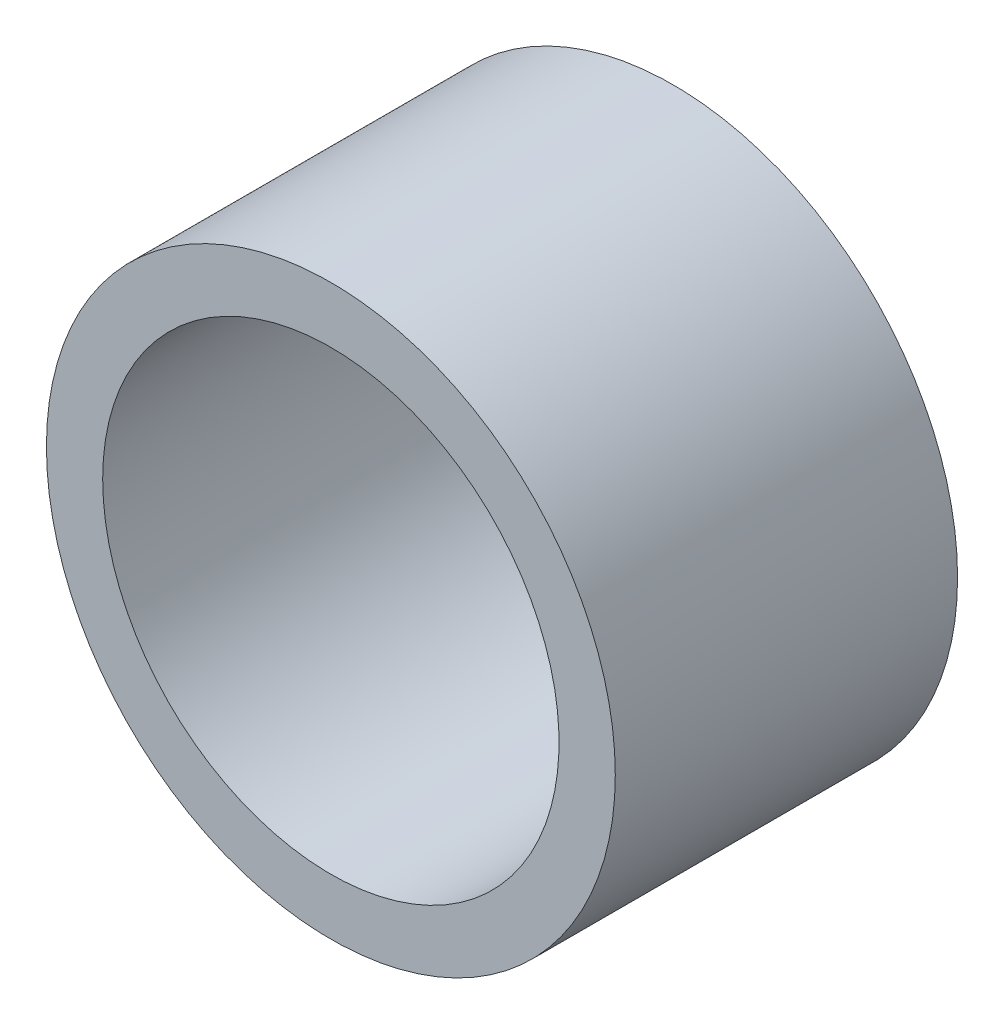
from build123d import *

# Parameters (mm, degrees)
SKETCH1_R      = 31.6611
SKETCH1_R_2    = 25.4
EXTRUDE1_DEPTH = 38.1


with BuildPart() as part:
    # Sketch1 → Extrude1 (new body)
    with BuildSketch(Plane.XY):
        with Locations(Location((0, 0, 0), (0, 0, 180))):
            Circle(SKETCH1_R)
        with Locations(Location((0, 0, 0), (0, 0, 180))):
            Circle(SKETCH1_R_2, mode=Mode.SUBTRACT)
    extrude(amount=EXTRUDE1_DEPTH)


solid = part.part
